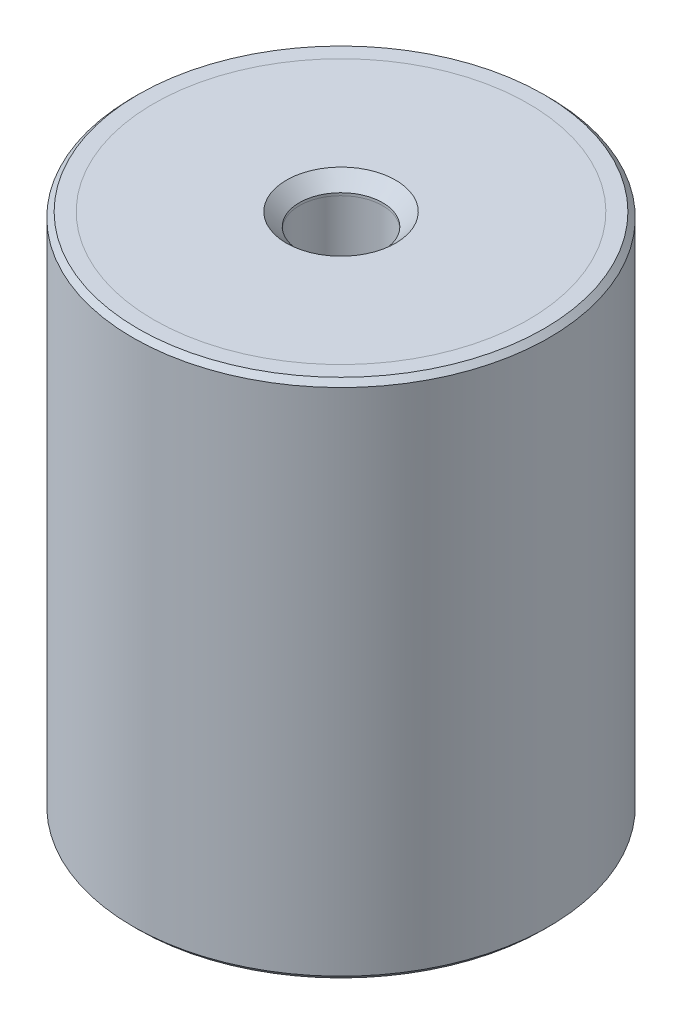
ISO-10303-21;
HEADER;
FILE_DESCRIPTION(('STEP AP214'),'2;1');
FILE_NAME('part.step','',(''),(''),'','','');
FILE_SCHEMA(('AUTOMOTIVE_DESIGN { 1 0 10303 214 1 1 1 1 }'));
ENDSEC;
DATA;
#1=APPLICATION_CONTEXT('core data for automotive mechanical design processes');
#2=APPLICATION_PROTOCOL_DEFINITION('international standard','automotive_design',2000,#1);
#3=PRODUCT_CONTEXT('',#1,'mechanical');
#4=PRODUCT('Part','Part','',(#3));
#5=PRODUCT_RELATED_PRODUCT_CATEGORY('part','',(#4));
#6=PRODUCT_DEFINITION_FORMATION('','',#4);
#7=PRODUCT_DEFINITION_CONTEXT('part definition',#1,'design');
#8=PRODUCT_DEFINITION('design','',#6,#7);
#9=PRODUCT_DEFINITION_SHAPE('','',#8);
#10=(LENGTH_UNIT() NAMED_UNIT(*) SI_UNIT(.MILLI.,.METRE.));
#11=(NAMED_UNIT(*) PLANE_ANGLE_UNIT() SI_UNIT($,.RADIAN.));
#12=(NAMED_UNIT(*) SI_UNIT($,.STERADIAN.) SOLID_ANGLE_UNIT());
#13=UNCERTAINTY_MEASURE_WITH_UNIT(LENGTH_MEASURE(1.E-05),#10,'distance_accuracy_value','');
#14=(GEOMETRIC_REPRESENTATION_CONTEXT(3) GLOBAL_UNCERTAINTY_ASSIGNED_CONTEXT((#13)) GLOBAL_UNIT_ASSIGNED_CONTEXT((#10,
#11,#12)) REPRESENTATION_CONTEXT('',''));
#15=CARTESIAN_POINT('',(0.,0.,0.));
#16=DIRECTION('',(0.,0.,1.));
#17=DIRECTION('',(1.,0.,0.));
#18=AXIS2_PLACEMENT_3D('',#15,#16,#17);
#19=CARTESIAN_POINT('',(0.,21.0340428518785,0.));
#20=DIRECTION('',(0.,1.,0.));
#21=DIRECTION('',(0.,0.,1.));
#22=AXIS2_PLACEMENT_3D('',#19,#20,#21);
#23=CYLINDRICAL_SURFACE('',#22,4.);
#24=CARTESIAN_POINT('',(0.,-47.25,0.));
#25=DIRECTION('',(0.,-1.,0.));
#26=DIRECTION('',(0.,0.,-1.));
#27=AXIS2_PLACEMENT_3D('',#24,#25,#26);
#28=CIRCLE('',#27,4.);
#29=CARTESIAN_POINT('',(0.,-47.25,-4.));
#30=VERTEX_POINT('',#29);
#31=EDGE_CURVE('P0_E10',#30,#30,#28,.T.);
#32=ORIENTED_EDGE('',*,*,#31,.T.);
#33=EDGE_LOOP('',(#32));
#34=FACE_BOUND('',#33,.T.);
#35=CARTESIAN_POINT('',(0.,-47.,0.));
#36=DIRECTION('',(0.,1.,0.));
#37=DIRECTION('',(0.,0.,1.));
#38=AXIS2_PLACEMENT_3D('',#35,#36,#37);
#39=CIRCLE('',#38,4.);
#40=CARTESIAN_POINT('',(0.,-47.,4.));
#41=VERTEX_POINT('',#40);
#42=EDGE_CURVE('P0_E25',#41,#41,#39,.T.);
#43=ORIENTED_EDGE('',*,*,#42,.T.);
#44=EDGE_LOOP('',(#43));
#45=FACE_BOUND('',#44,.T.);
#46=ADVANCED_FACE('P0_F14',(#34,#45),#23,.F.);
#47=CARTESIAN_POINT('',(0.,-47.,4.));
#48=DIRECTION('',(0.,1.,0.));
#49=DIRECTION('',(0.,0.,1.));
#50=AXIS2_PLACEMENT_3D('',#47,#48,#49);
#51=PLANE('',#50);
#52=CARTESIAN_POINT('',(0.,-47.,0.));
#53=DIRECTION('',(0.,1.,0.));
#54=DIRECTION('',(0.,0.,1.));
#55=AXIS2_PLACEMENT_3D('',#52,#53,#54);
#56=CIRCLE('',#55,18.);
#57=CARTESIAN_POINT('',(0.,-47.,18.));
#58=VERTEX_POINT('',#57);
#59=EDGE_CURVE('P0_E29',#58,#58,#56,.T.);
#60=ORIENTED_EDGE('',*,*,#59,.T.);
#61=EDGE_LOOP('',(#60));
#62=FACE_BOUND('',#61,.T.);
#63=ORIENTED_EDGE('',*,*,#42,.F.);
#64=EDGE_LOOP('',(#63));
#65=FACE_BOUND('',#64,.T.);
#66=ADVANCED_FACE('P0_F50',(#62,#65),#51,.T.);
#67=CARTESIAN_POINT('',(0.,21.0340428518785,0.));
#68=DIRECTION('',(0.,1.,0.));
#69=DIRECTION('',(0.,0.,1.));
#70=AXIS2_PLACEMENT_3D('',#67,#68,#69);
#71=CYLINDRICAL_SURFACE('',#70,18.);
#72=CARTESIAN_POINT('',(0.,-48.5,0.));
#73=DIRECTION('',(0.,1.,0.));
#74=DIRECTION('',(0.,0.,1.));
#75=AXIS2_PLACEMENT_3D('',#72,#73,#74);
#76=CIRCLE('',#75,18.);
#77=CARTESIAN_POINT('',(0.,-48.5,18.));
#78=VERTEX_POINT('',#77);
#79=EDGE_CURVE('P0_E34',#78,#78,#76,.T.);
#80=ORIENTED_EDGE('',*,*,#79,.T.);
#81=EDGE_LOOP('',(#80));
#82=FACE_BOUND('',#81,.T.);
#83=ORIENTED_EDGE('',*,*,#59,.F.);
#84=EDGE_LOOP('',(#83));
#85=FACE_BOUND('',#84,.T.);
#86=ADVANCED_FACE('P0_F38',(#82,#85),#71,.T.);
#87=CARTESIAN_POINT('',(0.,-48.5,18.));
#88=DIRECTION('',(0.,-1.,0.));
#89=DIRECTION('',(0.,0.,-1.));
#90=AXIS2_PLACEMENT_3D('',#87,#88,#89);
#91=PLANE('',#90);
#92=CARTESIAN_POINT('',(0.,-48.5,0.));
#93=DIRECTION('',(0.,-1.,0.));
#94=DIRECTION('',(0.,0.,-1.));
#95=AXIS2_PLACEMENT_3D('',#92,#93,#94);
#96=CIRCLE('',#95,5.25);
#97=CARTESIAN_POINT('',(0.,-48.5,-5.25));
#98=VERTEX_POINT('',#97);
#99=EDGE_CURVE('P0_E21',#98,#98,#96,.F.);
#100=ORIENTED_EDGE('',*,*,#99,.T.);
#101=EDGE_LOOP('',(#100));
#102=FACE_BOUND('',#101,.T.);
#103=ORIENTED_EDGE('',*,*,#79,.F.);
#104=EDGE_LOOP('',(#103));
#105=FACE_BOUND('',#104,.T.);
#106=ADVANCED_FACE('P0_F41',(#102,#105),#91,.T.);
#107=CARTESIAN_POINT('',(0.,-48.5,0.));
#108=DIRECTION('',(0.,-1.,0.));
#109=DIRECTION('',(0.,0.,-1.));
#110=AXIS2_PLACEMENT_3D('',#107,#108,#109);
#111=CONICAL_SURFACE('',#110,5.25,0.785398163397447);
#112=ORIENTED_EDGE('',*,*,#31,.F.);
#113=EDGE_LOOP('',(#112));
#114=FACE_BOUND('',#113,.T.);
#115=ORIENTED_EDGE('',*,*,#99,.F.);
#116=EDGE_LOOP('',(#115));
#117=FACE_BOUND('',#116,.T.);
#118=ADVANCED_FACE('P0_F16',(#114,#117),#111,.F.);
#119=CLOSED_SHELL('',(#46,#66,#86,#106,#118));
#120=MANIFOLD_SOLID_BREP('P0_B1',#119);
#121=CARTESIAN_POINT('',(0.,69.5340428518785,0.));
#122=DIRECTION('',(0.,1.,0.));
#123=DIRECTION('',(0.,0.,1.));
#124=AXIS2_PLACEMENT_3D('',#121,#122,#123);
#125=CYLINDRICAL_SURFACE('',#124,4.);
#126=CARTESIAN_POINT('',(0.,0.249999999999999,0.));
#127=DIRECTION('',(0.,1.,0.));
#128=DIRECTION('',(0.,0.,1.));
#129=AXIS2_PLACEMENT_3D('',#126,#127,#128);
#130=CIRCLE('',#129,4.);
#131=CARTESIAN_POINT('',(0.,0.249999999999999,4.));
#132=VERTEX_POINT('',#131);
#133=EDGE_CURVE('P1_E21',#132,#132,#130,.T.);
#134=ORIENTED_EDGE('',*,*,#133,.T.);
#135=EDGE_LOOP('',(#134));
#136=FACE_BOUND('',#135,.T.);
#137=CARTESIAN_POINT('',(0.,0.,0.));
#138=DIRECTION('',(0.,1.,0.));
#139=DIRECTION('',(0.,0.,1.));
#140=AXIS2_PLACEMENT_3D('',#137,#138,#139);
#141=CIRCLE('',#140,4.);
#142=CARTESIAN_POINT('',(0.,0.,4.));
#143=VERTEX_POINT('',#142);
#144=EDGE_CURVE('P1_E34',#143,#143,#141,.T.);
#145=ORIENTED_EDGE('',*,*,#144,.F.);
#146=EDGE_LOOP('',(#145));
#147=FACE_BOUND('',#146,.T.);
#148=ADVANCED_FACE('P1_F14',(#136,#147),#125,.F.);
#149=CARTESIAN_POINT('',(0.,1.5,4.));
#150=DIRECTION('',(0.,1.,0.));
#151=DIRECTION('',(0.,0.,1.));
#152=AXIS2_PLACEMENT_3D('',#149,#150,#151);
#153=PLANE('',#152);
#154=CARTESIAN_POINT('',(0.,1.5,0.));
#155=DIRECTION('',(0.,1.,0.));
#156=DIRECTION('',(0.,0.,1.));
#157=AXIS2_PLACEMENT_3D('',#154,#155,#156);
#158=CIRCLE('',#157,5.25);
#159=CARTESIAN_POINT('',(0.,1.5,5.25));
#160=VERTEX_POINT('',#159);
#161=EDGE_CURVE('P1_E10',#160,#160,#158,.F.);
#162=ORIENTED_EDGE('',*,*,#161,.T.);
#163=EDGE_LOOP('',(#162));
#164=FACE_BOUND('',#163,.T.);
#165=CARTESIAN_POINT('',(0.,1.5,0.));
#166=DIRECTION('',(0.,1.,0.));
#167=DIRECTION('',(0.,0.,1.));
#168=AXIS2_PLACEMENT_3D('',#165,#166,#167);
#169=CIRCLE('',#168,18.);
#170=CARTESIAN_POINT('',(0.,1.5,18.));
#171=VERTEX_POINT('',#170);
#172=EDGE_CURVE('P1_E25',#171,#171,#169,.T.);
#173=ORIENTED_EDGE('',*,*,#172,.T.);
#174=EDGE_LOOP('',(#173));
#175=FACE_BOUND('',#174,.T.);
#176=ADVANCED_FACE('P1_F42',(#164,#175),#153,.T.);
#177=CARTESIAN_POINT('',(0.,69.5340428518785,0.));
#178=DIRECTION('',(0.,1.,0.));
#179=DIRECTION('',(0.,0.,1.));
#180=AXIS2_PLACEMENT_3D('',#177,#178,#179);
#181=CYLINDRICAL_SURFACE('',#180,18.);
#182=CARTESIAN_POINT('',(0.,0.,0.));
#183=DIRECTION('',(0.,1.,0.));
#184=DIRECTION('',(0.,0.,1.));
#185=AXIS2_PLACEMENT_3D('',#182,#183,#184);
#186=CIRCLE('',#185,18.);
#187=CARTESIAN_POINT('',(0.,0.,18.));
#188=VERTEX_POINT('',#187);
#189=EDGE_CURVE('P1_E29',#188,#188,#186,.T.);
#190=ORIENTED_EDGE('',*,*,#189,.T.);
#191=EDGE_LOOP('',(#190));
#192=FACE_BOUND('',#191,.T.);
#193=ORIENTED_EDGE('',*,*,#172,.F.);
#194=EDGE_LOOP('',(#193));
#195=FACE_BOUND('',#194,.T.);
#196=ADVANCED_FACE('P1_F47',(#192,#195),#181,.T.);
#197=CARTESIAN_POINT('',(0.,0.,18.));
#198=DIRECTION('',(0.,-1.,0.));
#199=DIRECTION('',(0.,0.,-1.));
#200=AXIS2_PLACEMENT_3D('',#197,#198,#199);
#201=PLANE('',#200);
#202=ORIENTED_EDGE('',*,*,#144,.T.);
#203=EDGE_LOOP('',(#202));
#204=FACE_BOUND('',#203,.T.);
#205=ORIENTED_EDGE('',*,*,#189,.F.);
#206=EDGE_LOOP('',(#205));
#207=FACE_BOUND('',#206,.T.);
#208=ADVANCED_FACE('P1_F38',(#204,#207),#201,.T.);
#209=CARTESIAN_POINT('',(0.,0.249999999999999,0.));
#210=DIRECTION('',(0.,1.,0.));
#211=DIRECTION('',(0.,0.,1.));
#212=AXIS2_PLACEMENT_3D('',#209,#210,#211);
#213=CONICAL_SURFACE('',#212,4.,0.78539816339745);
#214=ORIENTED_EDGE('',*,*,#161,.F.);
#215=EDGE_LOOP('',(#214));
#216=FACE_BOUND('',#215,.T.);
#217=ORIENTED_EDGE('',*,*,#133,.F.);
#218=EDGE_LOOP('',(#217));
#219=FACE_BOUND('',#218,.T.);
#220=ADVANCED_FACE('P1_F16',(#216,#219),#213,.F.);
#221=CLOSED_SHELL('',(#148,#176,#196,#208,#220));
#222=MANIFOLD_SOLID_BREP('P1_B1',#221);
#223=CARTESIAN_POINT('',(0.,0.,0.));
#224=DIRECTION('',(0.,1.,0.));
#225=DIRECTION('',(0.,0.,1.));
#226=AXIS2_PLACEMENT_3D('',#223,#224,#225);
#227=PLANE('',#226);
#228=CARTESIAN_POINT('',(0.,0.,0.));
#229=DIRECTION('',(0.,1.,0.));
#230=DIRECTION('',(0.,0.,1.));
#231=AXIS2_PLACEMENT_3D('',#228,#229,#230);
#232=CIRCLE('',#231,4.);
#233=CARTESIAN_POINT('',(0.,0.,4.));
#234=VERTEX_POINT('',#233);
#235=EDGE_CURVE('P2_E46',#234,#234,#232,.T.);
#236=ORIENTED_EDGE('',*,*,#235,.F.);
#237=EDGE_LOOP('',(#236));
#238=FACE_BOUND('',#237,.T.);
#239=CARTESIAN_POINT('',(0.,0.,0.));
#240=DIRECTION('',(0.,1.,0.));
#241=DIRECTION('',(0.,0.,1.));
#242=AXIS2_PLACEMENT_3D('',#239,#240,#241);
#243=CIRCLE('',#242,18.);
#244=CARTESIAN_POINT('',(0.,0.,18.));
#245=VERTEX_POINT('',#244);
#246=EDGE_CURVE('P2_E33',#245,#245,#243,.T.);
#247=ORIENTED_EDGE('',*,*,#246,.T.);
#248=EDGE_LOOP('',(#247));
#249=FACE_BOUND('',#248,.T.);
#250=ADVANCED_FACE('P2_F13',(#238,#249),#227,.T.);
#251=CARTESIAN_POINT('',(0.,65.5134936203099,0.));
#252=DIRECTION('',(0.,1.,0.));
#253=DIRECTION('',(0.,0.,1.));
#254=AXIS2_PLACEMENT_3D('',#251,#252,#253);
#255=CYLINDRICAL_SURFACE('',#254,18.);
#256=CARTESIAN_POINT('',(0.,1.5,0.));
#257=DIRECTION('',(0.,1.,0.));
#258=DIRECTION('',(0.,0.,1.));
#259=AXIS2_PLACEMENT_3D('',#256,#257,#258);
#260=CIRCLE('',#259,18.);
#261=CARTESIAN_POINT('',(0.,1.5,18.));
#262=VERTEX_POINT('',#261);
#263=EDGE_CURVE('P2_E36',#262,#262,#260,.T.);
#264=ORIENTED_EDGE('',*,*,#263,.T.);
#265=EDGE_LOOP('',(#264));
#266=FACE_BOUND('',#265,.T.);
#267=ORIENTED_EDGE('',*,*,#246,.F.);
#268=EDGE_LOOP('',(#267));
#269=FACE_BOUND('',#268,.T.);
#270=ADVANCED_FACE('P2_F92',(#266,#269),#255,.F.);
#271=CARTESIAN_POINT('',(0.,1.5,18.));
#272=DIRECTION('',(0.,1.,0.));
#273=DIRECTION('',(0.,0.,1.));
#274=AXIS2_PLACEMENT_3D('',#271,#272,#273);
#275=PLANE('',#274);
#276=CARTESIAN_POINT('',(0.,1.5,0.));
#277=DIRECTION('',(0.,1.,0.));
#278=DIRECTION('',(0.,0.,1.));
#279=AXIS2_PLACEMENT_3D('',#276,#277,#278);
#280=CIRCLE('',#279,19.5);
#281=CARTESIAN_POINT('',(0.,1.5,19.5));
#282=VERTEX_POINT('',#281);
#283=EDGE_CURVE('P2_E9',#282,#282,#280,.T.);
#284=ORIENTED_EDGE('',*,*,#283,.T.);
#285=EDGE_LOOP('',(#284));
#286=FACE_BOUND('',#285,.T.);
#287=ORIENTED_EDGE('',*,*,#263,.F.);
#288=EDGE_LOOP('',(#287));
#289=FACE_BOUND('',#288,.T.);
#290=ADVANCED_FACE('P2_F88',(#286,#289),#275,.T.);
#291=CARTESIAN_POINT('',(0.,65.5134936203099,0.));
#292=DIRECTION('',(0.,1.,0.));
#293=DIRECTION('',(0.,0.,1.));
#294=AXIS2_PLACEMENT_3D('',#291,#292,#293);
#295=CYLINDRICAL_SURFACE('',#294,20.);
#296=CARTESIAN_POINT('',(0.,-48.,0.));
#297=DIRECTION('',(0.,-1.,0.));
#298=DIRECTION('',(0.,0.,-1.));
#299=AXIS2_PLACEMENT_3D('',#296,#297,#298);
#300=CIRCLE('',#299,20.);
#301=CARTESIAN_POINT('',(0.,-48.,-20.));
#302=VERTEX_POINT('',#301);
#303=EDGE_CURVE('P2_E24',#302,#302,#300,.F.);
#304=ORIENTED_EDGE('',*,*,#303,.T.);
#305=EDGE_LOOP('',(#304));
#306=FACE_BOUND('',#305,.T.);
#307=CARTESIAN_POINT('',(0.,1.00000000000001,0.));
#308=DIRECTION('',(0.,1.,0.));
#309=DIRECTION('',(0.,0.,1.));
#310=AXIS2_PLACEMENT_3D('',#307,#308,#309);
#311=CIRCLE('',#310,20.);
#312=CARTESIAN_POINT('',(0.,1.00000000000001,20.));
#313=VERTEX_POINT('',#312);
#314=EDGE_CURVE('P2_E28',#313,#313,#311,.F.);
#315=ORIENTED_EDGE('',*,*,#314,.T.);
#316=EDGE_LOOP('',(#315));
#317=FACE_BOUND('',#316,.T.);
#318=ADVANCED_FACE('P2_F82',(#306,#317),#295,.T.);
#319=CARTESIAN_POINT('',(0.,-48.5,20.));
#320=DIRECTION('',(0.,-1.,0.));
#321=DIRECTION('',(0.,0.,-1.));
#322=AXIS2_PLACEMENT_3D('',#319,#320,#321);
#323=PLANE('',#322);
#324=CARTESIAN_POINT('',(0.,-48.5,0.));
#325=DIRECTION('',(0.,-1.,0.));
#326=DIRECTION('',(0.,0.,-1.));
#327=AXIS2_PLACEMENT_3D('',#324,#325,#326);
#328=CIRCLE('',#327,19.5);
#329=CARTESIAN_POINT('',(0.,-48.5,-19.5));
#330=VERTEX_POINT('',#329);
#331=EDGE_CURVE('P2_E20',#330,#330,#328,.T.);
#332=ORIENTED_EDGE('',*,*,#331,.T.);
#333=EDGE_LOOP('',(#332));
#334=FACE_BOUND('',#333,.T.);
#335=CARTESIAN_POINT('',(0.,-48.5,0.));
#336=DIRECTION('',(0.,1.,0.));
#337=DIRECTION('',(0.,0.,1.));
#338=AXIS2_PLACEMENT_3D('',#335,#336,#337);
#339=CIRCLE('',#338,18.);
#340=CARTESIAN_POINT('',(0.,-48.5,18.));
#341=VERTEX_POINT('',#340);
#342=EDGE_CURVE('P2_E39',#341,#341,#339,.T.);
#343=ORIENTED_EDGE('',*,*,#342,.T.);
#344=EDGE_LOOP('',(#343));
#345=FACE_BOUND('',#344,.T.);
#346=ADVANCED_FACE('P2_F77',(#334,#345),#323,.T.);
#347=CARTESIAN_POINT('',(0.,65.5134936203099,0.));
#348=DIRECTION('',(0.,1.,0.));
#349=DIRECTION('',(0.,0.,1.));
#350=AXIS2_PLACEMENT_3D('',#347,#348,#349);
#351=CYLINDRICAL_SURFACE('',#350,18.);
#352=CARTESIAN_POINT('',(0.,-47.,0.));
#353=DIRECTION('',(0.,1.,0.));
#354=DIRECTION('',(0.,0.,1.));
#355=AXIS2_PLACEMENT_3D('',#352,#353,#354);
#356=CIRCLE('',#355,18.);
#357=CARTESIAN_POINT('',(0.,-47.,18.));
#358=VERTEX_POINT('',#357);
#359=EDGE_CURVE('P2_E42',#358,#358,#356,.T.);
#360=ORIENTED_EDGE('',*,*,#359,.T.);
#361=EDGE_LOOP('',(#360));
#362=FACE_BOUND('',#361,.T.);
#363=ORIENTED_EDGE('',*,*,#342,.F.);
#364=EDGE_LOOP('',(#363));
#365=FACE_BOUND('',#364,.T.);
#366=ADVANCED_FACE('P2_F71',(#362,#365),#351,.F.);
#367=CARTESIAN_POINT('',(0.,-47.,18.));
#368=DIRECTION('',(0.,-1.,0.));
#369=DIRECTION('',(0.,0.,-1.));
#370=AXIS2_PLACEMENT_3D('',#367,#368,#369);
#371=PLANE('',#370);
#372=CARTESIAN_POINT('',(0.,-47.,0.));
#373=DIRECTION('',(0.,-1.,0.));
#374=DIRECTION('',(0.,0.,-1.));
#375=AXIS2_PLACEMENT_3D('',#372,#373,#374);
#376=CIRCLE('',#375,4.);
#377=CARTESIAN_POINT('',(0.,-47.,-4.));
#378=VERTEX_POINT('',#377);
#379=EDGE_CURVE('P2_E52',#378,#378,#376,.T.);
#380=ORIENTED_EDGE('',*,*,#379,.F.);
#381=EDGE_LOOP('',(#380));
#382=FACE_BOUND('',#381,.T.);
#383=ORIENTED_EDGE('',*,*,#359,.F.);
#384=EDGE_LOOP('',(#383));
#385=FACE_BOUND('',#384,.T.);
#386=ADVANCED_FACE('P2_F67',(#382,#385),#371,.T.);
#387=CARTESIAN_POINT('',(0.,-48.,0.));
#388=DIRECTION('',(0.,1.,0.));
#389=DIRECTION('',(0.,0.,1.));
#390=AXIS2_PLACEMENT_3D('',#387,#388,#389);
#391=CONICAL_SURFACE('',#390,20.,0.785398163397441);
#392=ORIENTED_EDGE('',*,*,#331,.F.);
#393=EDGE_LOOP('',(#392));
#394=FACE_BOUND('',#393,.T.);
#395=ORIENTED_EDGE('',*,*,#303,.F.);
#396=EDGE_LOOP('',(#395));
#397=FACE_BOUND('',#396,.T.);
#398=ADVANCED_FACE('P2_F70',(#394,#397),#391,.T.);
#399=CARTESIAN_POINT('',(0.,1.5,0.));
#400=DIRECTION('',(0.,-1.,0.));
#401=DIRECTION('',(0.,0.,-1.));
#402=AXIS2_PLACEMENT_3D('',#399,#400,#401);
#403=CONICAL_SURFACE('',#402,19.5,0.785398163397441);
#404=ORIENTED_EDGE('',*,*,#314,.F.);
#405=EDGE_LOOP('',(#404));
#406=FACE_BOUND('',#405,.T.);
#407=ORIENTED_EDGE('',*,*,#283,.F.);
#408=EDGE_LOOP('',(#407));
#409=FACE_BOUND('',#408,.T.);
#410=ADVANCED_FACE('P2_F15',(#406,#409),#403,.T.);
#411=CARTESIAN_POINT('',(0.,-6.5,0.));
#412=DIRECTION('',(0.,1.,0.));
#413=DIRECTION('',(0.,0.,1.));
#414=AXIS2_PLACEMENT_3D('',#411,#412,#413);
#415=CYLINDRICAL_SURFACE('',#414,4.);
#416=CARTESIAN_POINT('',(0.,-6.5,0.));
#417=DIRECTION('',(0.,1.,0.));
#418=DIRECTION('',(0.,0.,1.));
#419=AXIS2_PLACEMENT_3D('',#416,#417,#418);
#420=CIRCLE('',#419,4.);
#421=CARTESIAN_POINT('',(0.,-6.5,4.));
#422=VERTEX_POINT('',#421);
#423=EDGE_CURVE('P2_E45',#422,#422,#420,.T.);
#424=CARTESIAN_POINT('',(0.,-6.5,4.));
#425=CARTESIAN_POINT('',(0.,-6.43229166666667,4.));
#426=CARTESIAN_POINT('',(0.,-6.36458333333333,4.));
#427=CARTESIAN_POINT('',(0.,-6.22916666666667,4.));
#428=CARTESIAN_POINT('',(0.,-6.16145833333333,4.));
#429=CARTESIAN_POINT('',(0.,-6.02604166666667,4.));
#430=CARTESIAN_POINT('',(0.,-5.95833333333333,4.));
#431=CARTESIAN_POINT('',(0.,-5.82291666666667,4.));
#432=CARTESIAN_POINT('',(0.,-5.75520833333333,4.));
#433=CARTESIAN_POINT('',(0.,-5.61979166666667,4.));
#434=CARTESIAN_POINT('',(0.,-5.55208333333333,4.));
#435=CARTESIAN_POINT('',(0.,-5.41666666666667,4.));
#436=CARTESIAN_POINT('',(0.,-5.34895833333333,4.));
#437=CARTESIAN_POINT('',(0.,-5.21354166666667,4.));
#438=CARTESIAN_POINT('',(0.,-5.14583333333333,4.));
#439=CARTESIAN_POINT('',(0.,-5.01041666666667,4.));
#440=CARTESIAN_POINT('',(0.,-4.94270833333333,4.));
#441=CARTESIAN_POINT('',(0.,-4.80729166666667,4.));
#442=CARTESIAN_POINT('',(0.,-4.73958333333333,4.));
#443=CARTESIAN_POINT('',(0.,-4.60416666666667,4.));
#444=CARTESIAN_POINT('',(0.,-4.53645833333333,4.));
#445=CARTESIAN_POINT('',(0.,-4.40104166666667,4.));
#446=CARTESIAN_POINT('',(0.,-4.33333333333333,4.));
#447=CARTESIAN_POINT('',(0.,-4.19791666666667,4.));
#448=CARTESIAN_POINT('',(0.,-4.13020833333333,4.));
#449=CARTESIAN_POINT('',(0.,-3.99479166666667,4.));
#450=CARTESIAN_POINT('',(0.,-3.92708333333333,4.));
#451=CARTESIAN_POINT('',(0.,-3.79166666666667,4.));
#452=CARTESIAN_POINT('',(0.,-3.72395833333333,4.));
#453=CARTESIAN_POINT('',(0.,-3.58854166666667,4.));
#454=CARTESIAN_POINT('',(0.,-3.52083333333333,4.));
#455=CARTESIAN_POINT('',(0.,-3.38541666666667,4.));
#456=CARTESIAN_POINT('',(0.,-3.31770833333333,4.));
#457=CARTESIAN_POINT('',(0.,-3.18229166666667,4.));
#458=CARTESIAN_POINT('',(0.,-3.11458333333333,4.));
#459=CARTESIAN_POINT('',(0.,-2.97916666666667,4.));
#460=CARTESIAN_POINT('',(0.,-2.91145833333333,4.));
#461=CARTESIAN_POINT('',(0.,-2.77604166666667,4.));
#462=CARTESIAN_POINT('',(0.,-2.70833333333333,4.));
#463=CARTESIAN_POINT('',(0.,-2.57291666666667,4.));
#464=CARTESIAN_POINT('',(0.,-2.50520833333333,4.));
#465=CARTESIAN_POINT('',(0.,-2.36979166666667,4.));
#466=CARTESIAN_POINT('',(0.,-2.30208333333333,4.));
#467=CARTESIAN_POINT('',(0.,-2.16666666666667,4.));
#468=CARTESIAN_POINT('',(0.,-2.09895833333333,4.));
#469=CARTESIAN_POINT('',(0.,-1.96354166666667,4.));
#470=CARTESIAN_POINT('',(0.,-1.89583333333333,4.));
#471=CARTESIAN_POINT('',(0.,-1.76041666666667,4.));
#472=CARTESIAN_POINT('',(0.,-1.69270833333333,4.));
#473=CARTESIAN_POINT('',(0.,-1.55729166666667,4.));
#474=CARTESIAN_POINT('',(0.,-1.48958333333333,4.));
#475=CARTESIAN_POINT('',(0.,-1.35416666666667,4.));
#476=CARTESIAN_POINT('',(0.,-1.28645833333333,4.));
#477=CARTESIAN_POINT('',(0.,-1.15104166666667,4.));
#478=CARTESIAN_POINT('',(0.,-1.08333333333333,4.));
#479=CARTESIAN_POINT('',(0.,-0.947916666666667,4.));
#480=CARTESIAN_POINT('',(0.,-0.880208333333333,4.));
#481=CARTESIAN_POINT('',(0.,-0.744791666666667,4.));
#482=CARTESIAN_POINT('',(0.,-0.677083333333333,4.));
#483=CARTESIAN_POINT('',(0.,-0.541666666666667,4.));
#484=CARTESIAN_POINT('',(0.,-0.473958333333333,4.));
#485=CARTESIAN_POINT('',(0.,-0.338541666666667,4.));
#486=CARTESIAN_POINT('',(0.,-0.270833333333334,4.));
#487=CARTESIAN_POINT('',(0.,-0.135416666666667,4.));
#488=CARTESIAN_POINT('',(0.,-0.0677083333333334,4.));
#489=CARTESIAN_POINT('',(0.,0.,4.));
#490=B_SPLINE_CURVE_WITH_KNOTS('',3,(#424,#425,#426,#427,#428,#429,#430,#431,#432,#433,#434,
#435,#436,#437,#438,#439,#440,#441,#442,#443,#444,#445,#446,#447,#448,#449,#450,#451,#452,#453,
#454,#455,#456,#457,#458,#459,#460,#461,#462,#463,#464,#465,#466,#467,#468,#469,#470,#471,#472,
#473,#474,#475,#476,#477,#478,#479,#480,#481,#482,#483,#484,#485,#486,#487,#488,#489),
.UNSPECIFIED.,.F.,.F.,(4,2,2,2,2,2,2,2,2,2,2,2,2,2,2,2,2,2,2,2,2,2,2,2,2,2,2,2,2,2,2,2,4),(0.,
0.203124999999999,0.40625,0.609375,0.8125,1.015625,1.21875,1.421875,1.625,1.828125,2.03125,
2.234375,2.4375,2.640625,2.84375,3.046875,3.25,3.453125,3.65625,3.859375,4.0625,4.265625,
4.46875,4.671875,4.875,5.078125,5.28125,5.484375,5.6875,5.890625,6.09375,6.296875,6.5),.UNSPECIFIED.);
#491=EDGE_CURVE('P2_BSEAM108',#422,#234,#490,.T.);
#492=ORIENTED_EDGE('',*,*,#423,.F.);
#493=ORIENTED_EDGE('',*,*,#235,.T.);
#494=ORIENTED_EDGE('',*,*,#491,.T.);
#495=ORIENTED_EDGE('',*,*,#491,.F.);
#496=EDGE_LOOP('',(#492,#494,#493,#495));
#497=FACE_BOUND('',#496,.T.);
#498=ADVANCED_FACE('P2_F108',(#497),#415,.F.);
#499=CARTESIAN_POINT('',(0.,-6.5,0.));
#500=DIRECTION('',(0.,1.,0.));
#501=DIRECTION('',(0.,0.,1.));
#502=AXIS2_PLACEMENT_3D('',#499,#500,#501);
#503=PLANE('',#502);
#504=ORIENTED_EDGE('',*,*,#423,.T.);
#505=EDGE_LOOP('',(#504));
#506=FACE_BOUND('',#505,.T.);
#507=ADVANCED_FACE('P2_F63',(#506),#503,.T.);
#508=CARTESIAN_POINT('',(0.,-40.5,0.));
#509=DIRECTION('',(0.,-1.,0.));
#510=DIRECTION('',(0.,0.,-1.));
#511=AXIS2_PLACEMENT_3D('',#508,#509,#510);
#512=CYLINDRICAL_SURFACE('',#511,4.);
#513=CARTESIAN_POINT('',(0.,-40.5,0.));
#514=DIRECTION('',(0.,-1.,0.));
#515=DIRECTION('',(0.,0.,-1.));
#516=AXIS2_PLACEMENT_3D('',#513,#514,#515);
#517=CIRCLE('',#516,4.);
#518=CARTESIAN_POINT('',(0.,-40.5,-4.));
#519=VERTEX_POINT('',#518);
#520=EDGE_CURVE('P2_E49',#519,#519,#517,.T.);
#521=CARTESIAN_POINT('',(0.,-40.5,-4.));
#522=CARTESIAN_POINT('',(0.,-40.5677083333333,-4.));
#523=CARTESIAN_POINT('',(0.,-40.6354166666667,-4.));
#524=CARTESIAN_POINT('',(0.,-40.7708333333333,-4.));
#525=CARTESIAN_POINT('',(0.,-40.8385416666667,-4.));
#526=CARTESIAN_POINT('',(0.,-40.9739583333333,-4.));
#527=CARTESIAN_POINT('',(0.,-41.0416666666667,-4.));
#528=CARTESIAN_POINT('',(0.,-41.1770833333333,-4.));
#529=CARTESIAN_POINT('',(0.,-41.2447916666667,-4.));
#530=CARTESIAN_POINT('',(0.,-41.3802083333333,-4.));
#531=CARTESIAN_POINT('',(0.,-41.4479166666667,-4.));
#532=CARTESIAN_POINT('',(0.,-41.5833333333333,-4.));
#533=CARTESIAN_POINT('',(0.,-41.6510416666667,-4.));
#534=CARTESIAN_POINT('',(0.,-41.7864583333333,-4.));
#535=CARTESIAN_POINT('',(0.,-41.8541666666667,-4.));
#536=CARTESIAN_POINT('',(0.,-41.9895833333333,-4.));
#537=CARTESIAN_POINT('',(0.,-42.0572916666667,-4.));
#538=CARTESIAN_POINT('',(0.,-42.1927083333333,-4.));
#539=CARTESIAN_POINT('',(0.,-42.2604166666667,-4.));
#540=CARTESIAN_POINT('',(0.,-42.3958333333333,-4.));
#541=CARTESIAN_POINT('',(0.,-42.4635416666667,-4.));
#542=CARTESIAN_POINT('',(0.,-42.5989583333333,-4.));
#543=CARTESIAN_POINT('',(0.,-42.6666666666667,-4.));
#544=CARTESIAN_POINT('',(0.,-42.8020833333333,-4.));
#545=CARTESIAN_POINT('',(0.,-42.8697916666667,-4.));
#546=CARTESIAN_POINT('',(0.,-43.0052083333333,-4.));
#547=CARTESIAN_POINT('',(0.,-43.0729166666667,-4.));
#548=CARTESIAN_POINT('',(0.,-43.2083333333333,-4.));
#549=CARTESIAN_POINT('',(0.,-43.2760416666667,-4.));
#550=CARTESIAN_POINT('',(0.,-43.4114583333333,-4.));
#551=CARTESIAN_POINT('',(0.,-43.4791666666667,-4.));
#552=CARTESIAN_POINT('',(0.,-43.6145833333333,-4.));
#553=CARTESIAN_POINT('',(0.,-43.6822916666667,-4.));
#554=CARTESIAN_POINT('',(0.,-43.8177083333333,-4.));
#555=CARTESIAN_POINT('',(0.,-43.8854166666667,-4.));
#556=CARTESIAN_POINT('',(0.,-44.0208333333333,-4.));
#557=CARTESIAN_POINT('',(0.,-44.0885416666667,-4.));
#558=CARTESIAN_POINT('',(0.,-44.2239583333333,-4.));
#559=CARTESIAN_POINT('',(0.,-44.2916666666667,-4.));
#560=CARTESIAN_POINT('',(0.,-44.4270833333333,-4.));
#561=CARTESIAN_POINT('',(0.,-44.4947916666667,-4.));
#562=CARTESIAN_POINT('',(0.,-44.6302083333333,-4.));
#563=CARTESIAN_POINT('',(0.,-44.6979166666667,-4.));
#564=CARTESIAN_POINT('',(0.,-44.8333333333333,-4.));
#565=CARTESIAN_POINT('',(0.,-44.9010416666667,-4.));
#566=CARTESIAN_POINT('',(0.,-45.0364583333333,-4.));
#567=CARTESIAN_POINT('',(0.,-45.1041666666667,-4.));
#568=CARTESIAN_POINT('',(0.,-45.2395833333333,-4.));
#569=CARTESIAN_POINT('',(0.,-45.3072916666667,-4.));
#570=CARTESIAN_POINT('',(0.,-45.4427083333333,-4.));
#571=CARTESIAN_POINT('',(0.,-45.5104166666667,-4.));
#572=CARTESIAN_POINT('',(0.,-45.6458333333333,-4.));
#573=CARTESIAN_POINT('',(0.,-45.7135416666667,-4.));
#574=CARTESIAN_POINT('',(0.,-45.8489583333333,-4.));
#575=CARTESIAN_POINT('',(0.,-45.9166666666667,-4.));
#576=CARTESIAN_POINT('',(0.,-46.0520833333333,-4.));
#577=CARTESIAN_POINT('',(0.,-46.1197916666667,-4.));
#578=CARTESIAN_POINT('',(0.,-46.2552083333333,-4.));
#579=CARTESIAN_POINT('',(0.,-46.3229166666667,-4.));
#580=CARTESIAN_POINT('',(0.,-46.4583333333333,-4.));
#581=CARTESIAN_POINT('',(0.,-46.5260416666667,-4.));
#582=CARTESIAN_POINT('',(0.,-46.6614583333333,-4.));
#583=CARTESIAN_POINT('',(0.,-46.7291666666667,-4.));
#584=CARTESIAN_POINT('',(0.,-46.8645833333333,-4.));
#585=CARTESIAN_POINT('',(0.,-46.9322916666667,-4.));
#586=CARTESIAN_POINT('',(0.,-47.,-4.));
#587=B_SPLINE_CURVE_WITH_KNOTS('',3,(#521,#522,#523,#524,#525,#526,#527,#528,#529,#530,#531,
#532,#533,#534,#535,#536,#537,#538,#539,#540,#541,#542,#543,#544,#545,#546,#547,#548,#549,#550,
#551,#552,#553,#554,#555,#556,#557,#558,#559,#560,#561,#562,#563,#564,#565,#566,#567,#568,#569,
#570,#571,#572,#573,#574,#575,#576,#577,#578,#579,#580,#581,#582,#583,#584,#585,#586),
.UNSPECIFIED.,.F.,.F.,(4,2,2,2,2,2,2,2,2,2,2,2,2,2,2,2,2,2,2,2,2,2,2,2,2,2,2,2,2,2,2,2,4),(0.,
0.203125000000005,0.406250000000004,0.609375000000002,0.812500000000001,1.01562500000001,
1.21875,1.421875,1.625,1.828125,2.03125000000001,2.234375,2.4375,2.640625,2.84375000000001,
3.046875,3.25,3.453125,3.65625,3.85937500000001,4.0625,4.265625,4.46875,4.671875,4.875,5.078125,
5.28125,5.484375,5.6875,5.890625,6.09375,6.296875,6.5),.UNSPECIFIED.);
#588=EDGE_CURVE('P2_BSEAM60',#519,#378,#587,.T.);
#589=ORIENTED_EDGE('',*,*,#520,.F.);
#590=ORIENTED_EDGE('',*,*,#379,.T.);
#591=ORIENTED_EDGE('',*,*,#588,.T.);
#592=ORIENTED_EDGE('',*,*,#588,.F.);
#593=EDGE_LOOP('',(#589,#591,#590,#592));
#594=FACE_BOUND('',#593,.T.);
#595=ADVANCED_FACE('P2_F60',(#594),#512,.F.);
#596=CARTESIAN_POINT('',(0.,-40.5,0.));
#597=DIRECTION('',(0.,-1.,0.));
#598=DIRECTION('',(0.,0.,-1.));
#599=AXIS2_PLACEMENT_3D('',#596,#597,#598);
#600=PLANE('',#599);
#601=ORIENTED_EDGE('',*,*,#520,.T.);
#602=EDGE_LOOP('',(#601));
#603=FACE_BOUND('',#602,.T.);
#604=ADVANCED_FACE('P2_F58',(#603),#600,.T.);
#605=CLOSED_SHELL('',(#250,#270,#290,#318,#346,#366,#386,#398,#410,#498,#507,#595,#604));
#606=MANIFOLD_SOLID_BREP('P2_B1',#605);
#607=ADVANCED_BREP_SHAPE_REPRESENTATION('',(#18,#120,#222,#606),#14);
#608=SHAPE_DEFINITION_REPRESENTATION(#9,#607);
ENDSEC;
END-ISO-10303-21;
